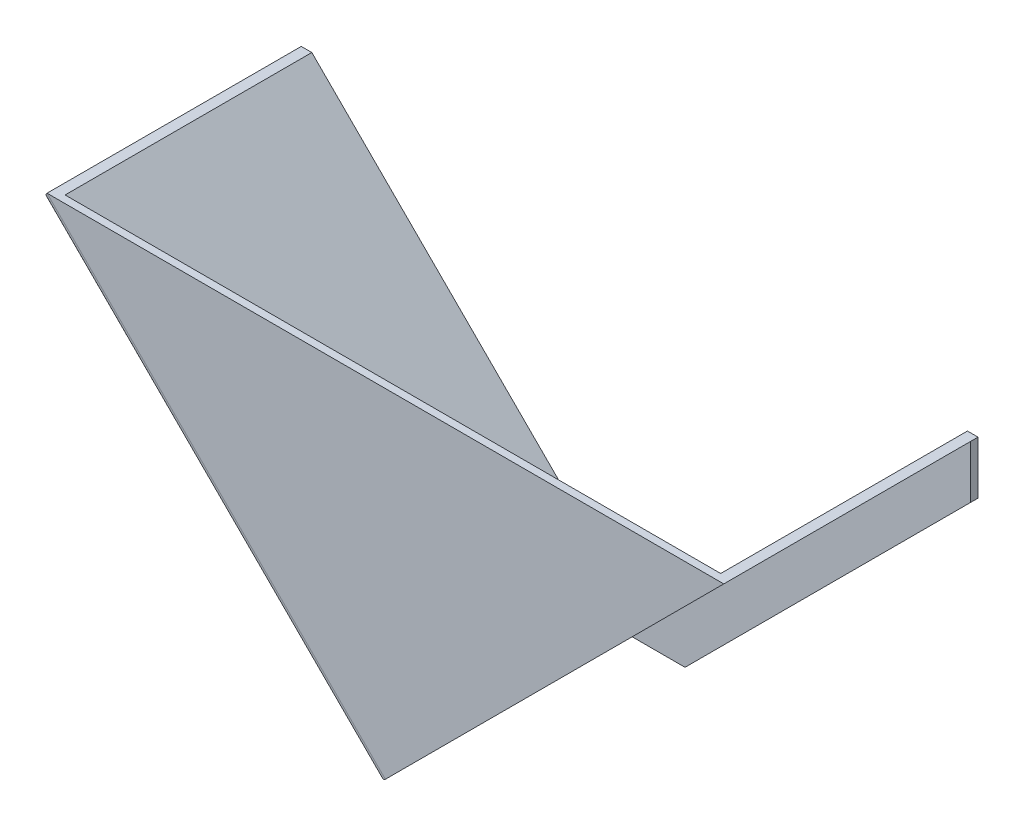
ISO-10303-21;
HEADER;
FILE_DESCRIPTION(('STEP AP214'),'2;1');
FILE_NAME('part.step','',(''),(''),'','','');
FILE_SCHEMA(('AUTOMOTIVE_DESIGN { 1 0 10303 214 1 1 1 1 }'));
ENDSEC;
DATA;
#1=APPLICATION_CONTEXT('core data for automotive mechanical design processes');
#2=APPLICATION_PROTOCOL_DEFINITION('international standard','automotive_design',2000,#1);
#3=PRODUCT_CONTEXT('',#1,'mechanical');
#4=PRODUCT('Part','Part','',(#3));
#5=PRODUCT_RELATED_PRODUCT_CATEGORY('part','',(#4));
#6=PRODUCT_DEFINITION_FORMATION('','',#4);
#7=PRODUCT_DEFINITION_CONTEXT('part definition',#1,'design');
#8=PRODUCT_DEFINITION('design','',#6,#7);
#9=PRODUCT_DEFINITION_SHAPE('','',#8);
#10=(LENGTH_UNIT() NAMED_UNIT(*) SI_UNIT(.MILLI.,.METRE.));
#11=(NAMED_UNIT(*) PLANE_ANGLE_UNIT() SI_UNIT($,.RADIAN.));
#12=(NAMED_UNIT(*) SI_UNIT($,.STERADIAN.) SOLID_ANGLE_UNIT());
#13=UNCERTAINTY_MEASURE_WITH_UNIT(LENGTH_MEASURE(1.E-05),#10,'distance_accuracy_value','');
#14=(GEOMETRIC_REPRESENTATION_CONTEXT(3) GLOBAL_UNCERTAINTY_ASSIGNED_CONTEXT((#13)) GLOBAL_UNIT_ASSIGNED_CONTEXT((#10,
#11,#12)) REPRESENTATION_CONTEXT('',''));
#15=CARTESIAN_POINT('',(0.,0.,0.));
#16=DIRECTION('',(0.,0.,1.));
#17=DIRECTION('',(1.,0.,0.));
#18=AXIS2_PLACEMENT_3D('',#15,#16,#17);
#19=CARTESIAN_POINT('',(0.,0.,0.));
#20=DIRECTION('',(0.,0.,1.));
#21=DIRECTION('',(1.,0.,0.));
#22=AXIS2_PLACEMENT_3D('',#19,#20,#21);
#23=PLANE('',#22);
#24=DIRECTION('',(0.707106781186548,0.707106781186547,0.));
#25=VECTOR('',#24,1.);
#26=CARTESIAN_POINT('',(0.,1.4142135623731,0.));
#27=LINE('',#26,#25);
#28=CARTESIAN_POINT('',(0.,1.4142135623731,0.));
#29=VERTEX_POINT('',#28);
#30=CARTESIAN_POINT('',(43.840620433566,45.2548339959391,0.));
#31=VERTEX_POINT('',#30);
#32=EDGE_CURVE('E206',#29,#31,#27,.T.);
#33=ORIENTED_EDGE('',*,*,#32,.F.);
#34=DIRECTION('',(0.707106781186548,-0.707106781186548,0.));
#35=VECTOR('',#34,1.);
#36=CARTESIAN_POINT('',(-43.840620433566,45.254833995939,0.));
#37=LINE('',#36,#35);
#38=CARTESIAN_POINT('',(-43.840620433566,45.254833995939,0.));
#39=VERTEX_POINT('',#38);
#40=EDGE_CURVE('E144',#39,#29,#37,.T.);
#41=ORIENTED_EDGE('',*,*,#40,.F.);
#42=DIRECTION('',(-1.,0.,0.));
#43=VECTOR('',#42,1.);
#44=CARTESIAN_POINT('',(45.254833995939,45.254833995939,0.));
#45=LINE('',#44,#43);
#46=EDGE_CURVE('E234',#31,#39,#45,.T.);
#47=ORIENTED_EDGE('',*,*,#46,.F.);
#48=EDGE_LOOP('',(#33,#41,#47));
#49=FACE_BOUND('',#48,.T.);
#50=ADVANCED_FACE('F31',(#49),#23,.F.);
#51=CARTESIAN_POINT('',(-45.254833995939,45.254833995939,1.));
#52=DIRECTION('',(0.707106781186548,0.707106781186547,0.));
#53=DIRECTION('',(-0.707106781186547,0.707106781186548,0.));
#54=AXIS2_PLACEMENT_3D('',#51,#52,#53);
#55=PLANE('',#54);
#56=DIRECTION('',(0.,0.,-1.));
#57=VECTOR('',#56,1.);
#58=CARTESIAN_POINT('',(-45.254833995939,45.254833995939,1.));
#59=LINE('',#58,#57);
#60=CARTESIAN_POINT('',(-45.254833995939,45.254833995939,1.));
#61=VERTEX_POINT('',#60);
#62=CARTESIAN_POINT('',(-45.254833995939,45.254833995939,-31.));
#63=VERTEX_POINT('',#62);
#64=EDGE_CURVE('E240',#61,#63,#59,.T.);
#65=ORIENTED_EDGE('',*,*,#64,.T.);
#66=DIRECTION('',(-0.707106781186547,0.707106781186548,0.));
#67=VECTOR('',#66,1.);
#68=CARTESIAN_POINT('',(0.,0.,-31.));
#69=LINE('',#68,#67);
#70=CARTESIAN_POINT('',(0.,0.,-31.0000029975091));
#71=VERTEX_POINT('',#70);
#72=EDGE_CURVE('E261',#63,#71,#69,.F.);
#73=ORIENTED_EDGE('',*,*,#72,.T.);
#74=DIRECTION('',(0.,0.,-1.));
#75=VECTOR('',#74,1.);
#76=CARTESIAN_POINT('',(0.,0.,1.));
#77=LINE('',#76,#75);
#78=CARTESIAN_POINT('',(0.,0.,1.));
#79=VERTEX_POINT('',#78);
#80=EDGE_CURVE('E246',#79,#71,#77,.T.);
#81=ORIENTED_EDGE('',*,*,#80,.F.);
#82=DIRECTION('',(0.499999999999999,-0.499999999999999,0.707106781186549));
#83=VECTOR('',#82,1.);
#84=CARTESIAN_POINT('',(-4.24264068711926,4.24264068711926,-4.99999999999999));
#85=LINE('',#84,#83);
#86=CARTESIAN_POINT('',(-4.24264068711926,4.24264068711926,-4.99999999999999));
#87=VERTEX_POINT('',#86);
#88=EDGE_CURVE('E217',#87,#79,#85,.T.);
#89=ORIENTED_EDGE('',*,*,#88,.F.);
#90=DIRECTION('',(0.707106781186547,-0.707106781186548,0.));
#91=VECTOR('',#90,1.);
#92=CARTESIAN_POINT('',(-41.0121933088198,41.0121933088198,-5.));
#93=LINE('',#92,#91);
#94=CARTESIAN_POINT('',(-41.0121933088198,41.0121933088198,-5.));
#95=VERTEX_POINT('',#94);
#96=EDGE_CURVE('E224',#95,#87,#93,.T.);
#97=ORIENTED_EDGE('',*,*,#96,.F.);
#98=DIRECTION('',(0.499999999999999,-0.499999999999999,-0.707106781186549));
#99=VECTOR('',#98,1.);
#100=CARTESIAN_POINT('',(-45.254833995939,45.254833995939,1.));
#101=LINE('',#100,#99);
#102=EDGE_CURVE('E213',#61,#95,#101,.T.);
#103=ORIENTED_EDGE('',*,*,#102,.F.);
#104=EDGE_LOOP('',(#65,#73,#81,#89,#97,#103));
#105=FACE_BOUND('',#104,.T.);
#106=ADVANCED_FACE('F312',(#105),#55,.F.);
#107=CARTESIAN_POINT('',(0.,0.,1.));
#108=DIRECTION('',(-0.707106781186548,0.707106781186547,0.));
#109=DIRECTION('',(-0.707106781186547,-0.707106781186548,0.));
#110=AXIS2_PLACEMENT_3D('',#107,#108,#109);
#111=PLANE('',#110);
#112=ORIENTED_EDGE('',*,*,#80,.T.);
#113=DIRECTION('',(0.,0.,1.));
#114=VECTOR('',#113,1.);
#115=CARTESIAN_POINT('',(0.,0.,-33.));
#116=LINE('',#115,#114);
#117=CARTESIAN_POINT('',(0.,0.,-32.));
#118=VERTEX_POINT('',#117);
#119=EDGE_CURVE('E11',#118,#71,#116,.T.);
#120=ORIENTED_EDGE('',*,*,#119,.F.);
#121=DIRECTION('',(-0.707106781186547,-0.707106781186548,0.));
#122=VECTOR('',#121,1.);
#123=CARTESIAN_POINT('',(0.,0.,-32.));
#124=LINE('',#123,#122);
#125=CARTESIAN_POINT('',(45.254833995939,45.254833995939,-32.));
#126=VERTEX_POINT('',#125);
#127=EDGE_CURVE('E149',#126,#118,#124,.T.);
#128=ORIENTED_EDGE('',*,*,#127,.F.);
#129=DIRECTION('',(0.,0.,-1.));
#130=VECTOR('',#129,1.);
#131=CARTESIAN_POINT('',(45.254833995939,45.254833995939,1.));
#132=LINE('',#131,#130);
#133=CARTESIAN_POINT('',(45.254833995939,45.254833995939,1.));
#134=VERTEX_POINT('',#133);
#135=EDGE_CURVE('E244',#134,#126,#132,.T.);
#136=ORIENTED_EDGE('',*,*,#135,.F.);
#137=DIRECTION('',(0.707106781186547,0.707106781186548,0.));
#138=VECTOR('',#137,1.);
#139=CARTESIAN_POINT('',(0.,0.,1.));
#140=LINE('',#139,#138);
#141=EDGE_CURVE('E235',#79,#134,#140,.T.);
#142=ORIENTED_EDGE('',*,*,#141,.F.);
#143=EDGE_LOOP('',(#112,#120,#128,#136,#142));
#144=FACE_BOUND('',#143,.T.);
#145=ADVANCED_FACE('F299',(#144),#111,.F.);
#146=CARTESIAN_POINT('',(45.254833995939,45.254833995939,1.));
#147=DIRECTION('',(0.,-1.,0.));
#148=DIRECTION('',(0.,0.,-1.));
#149=AXIS2_PLACEMENT_3D('',#146,#147,#148);
#150=PLANE('',#149);
#151=ORIENTED_EDGE('',*,*,#135,.T.);
#152=DIRECTION('',(0.,0.,1.));
#153=VECTOR('',#152,1.);
#154=CARTESIAN_POINT('',(45.254833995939,45.254833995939,-33.));
#155=LINE('',#154,#153);
#156=CARTESIAN_POINT('',(45.254833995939,45.254833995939,-33.));
#157=VERTEX_POINT('',#156);
#158=EDGE_CURVE('E203',#157,#126,#155,.T.);
#159=ORIENTED_EDGE('',*,*,#158,.F.);
#160=DIRECTION('',(1.,0.,0.));
#161=VECTOR('',#160,1.);
#162=CARTESIAN_POINT('',(45.254833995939,45.254833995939,-33.));
#163=LINE('',#162,#161);
#164=CARTESIAN_POINT('',(43.840620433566,45.2548339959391,-33.));
#165=VERTEX_POINT('',#164);
#166=EDGE_CURVE('E157',#165,#157,#163,.T.);
#167=ORIENTED_EDGE('',*,*,#166,.F.);
#168=DIRECTION('',(0.,0.,1.));
#169=VECTOR('',#168,1.);
#170=CARTESIAN_POINT('',(43.840620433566,45.2548339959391,-32.));
#171=LINE('',#170,#169);
#172=EDGE_CURVE('E154',#165,#31,#171,.T.);
#173=ORIENTED_EDGE('',*,*,#172,.T.);
#174=ORIENTED_EDGE('',*,*,#46,.T.);
#175=DIRECTION('',(0.,0.,1.));
#176=VECTOR('',#175,1.);
#177=CARTESIAN_POINT('',(-43.840620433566,45.254833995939,-32.));
#178=LINE('',#177,#176);
#179=CARTESIAN_POINT('',(-43.840620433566,45.254833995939,-33.));
#180=VERTEX_POINT('',#179);
#181=EDGE_CURVE('E148',#180,#39,#178,.T.);
#182=ORIENTED_EDGE('',*,*,#181,.F.);
#183=DIRECTION('',(1.,0.,0.));
#184=VECTOR('',#183,1.);
#185=CARTESIAN_POINT('',(-43.840620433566,45.254833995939,-33.));
#186=LINE('',#185,#184);
#187=CARTESIAN_POINT('',(-45.254833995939,45.254833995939,-33.));
#188=VERTEX_POINT('',#187);
#189=EDGE_CURVE('E161',#188,#180,#186,.T.);
#190=ORIENTED_EDGE('',*,*,#189,.F.);
#191=DIRECTION('',(0.,0.,1.));
#192=VECTOR('',#191,1.);
#193=CARTESIAN_POINT('',(-45.254833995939,45.254833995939,-33.));
#194=LINE('',#193,#192);
#195=EDGE_CURVE('E46',#188,#63,#194,.T.);
#196=ORIENTED_EDGE('',*,*,#195,.T.);
#197=ORIENTED_EDGE('',*,*,#64,.F.);
#198=DIRECTION('',(-1.,0.,0.));
#199=VECTOR('',#198,1.);
#200=CARTESIAN_POINT('',(45.254833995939,45.254833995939,1.));
#201=LINE('',#200,#199);
#202=EDGE_CURVE('E237',#134,#61,#201,.T.);
#203=ORIENTED_EDGE('',*,*,#202,.F.);
#204=EDGE_LOOP('',(#151,#159,#167,#173,#174,#182,#190,#196,#197,#203));
#205=FACE_BOUND('',#204,.T.);
#206=ADVANCED_FACE('F305',(#205),#150,.F.);
#207=CARTESIAN_POINT('',(0.,0.,1.));
#208=DIRECTION('',(0.,0.,1.));
#209=DIRECTION('',(1.,0.,0.));
#210=AXIS2_PLACEMENT_3D('',#207,#208,#209);
#211=PLANE('',#210);
#212=ORIENTED_EDGE('',*,*,#202,.T.);
#213=DIRECTION('',(-0.707106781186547,0.707106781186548,0.));
#214=VECTOR('',#213,1.);
#215=CARTESIAN_POINT('',(0.,0.,1.));
#216=LINE('',#215,#214);
#217=EDGE_CURVE('E254',#61,#79,#216,.F.);
#218=ORIENTED_EDGE('',*,*,#217,.T.);
#219=ORIENTED_EDGE('',*,*,#141,.T.);
#220=EDGE_LOOP('',(#212,#218,#219));
#221=FACE_BOUND('',#220,.T.);
#222=ADVANCED_FACE('F308',(#221),#211,.T.);
#223=CARTESIAN_POINT('',(-45.9619407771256,44.5477272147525,1.));
#224=DIRECTION('',(0.500000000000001,-0.500000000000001,0.707106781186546));
#225=DIRECTION('',(0.,-0.816496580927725,-0.577350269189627));
#226=AXIS2_PLACEMENT_3D('',#223,#224,#225);
#227=PLANE('',#226);
#228=DIRECTION('',(0.499999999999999,-0.499999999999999,-0.707106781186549));
#229=VECTOR('',#228,1.);
#230=CARTESIAN_POINT('',(-45.9619407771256,44.5477272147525,1.));
#231=LINE('',#230,#229);
#232=CARTESIAN_POINT('',(-45.254833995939,43.840620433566,0.));
#233=VERTEX_POINT('',#232);
#234=CARTESIAN_POINT('',(-41.7193000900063,40.3050865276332,-5.));
#235=VERTEX_POINT('',#234);
#236=EDGE_CURVE('E214',#233,#235,#231,.T.);
#237=ORIENTED_EDGE('',*,*,#236,.F.);
#238=CARTESIAN_POINT('',(-44.5477272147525,44.5477272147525,0.));
#239=DIRECTION('',(0.500000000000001,-0.500000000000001,0.707106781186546));
#240=DIRECTION('',(-0.499999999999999,0.499999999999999,0.707106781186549));
#241=AXIS2_PLACEMENT_3D('',#238,#239,#240);
#242=ELLIPSE('',#241,1.41421356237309,1.);
#243=EDGE_CURVE('E252',#233,#61,#242,.F.);
#244=ORIENTED_EDGE('',*,*,#243,.T.);
#245=ORIENTED_EDGE('',*,*,#102,.T.);
#246=DIRECTION('',(0.707106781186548,0.707106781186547,0.));
#247=VECTOR('',#246,1.);
#248=CARTESIAN_POINT('',(-41.7193000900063,40.3050865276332,-5.));
#249=LINE('',#248,#247);
#250=EDGE_CURVE('E231',#235,#95,#249,.T.);
#251=ORIENTED_EDGE('',*,*,#250,.F.);
#252=EDGE_LOOP('',(#237,#244,#245,#251));
#253=FACE_BOUND('',#252,.T.);
#254=ADVANCED_FACE('F330',(#253),#227,.F.);
#255=CARTESIAN_POINT('',(-41.7193000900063,40.3050865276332,-5.));
#256=DIRECTION('',(0.,0.,1.));
#257=DIRECTION('',(0.,-1.,0.));
#258=AXIS2_PLACEMENT_3D('',#255,#256,#257);
#259=PLANE('',#258);
#260=ORIENTED_EDGE('',*,*,#96,.T.);
#261=DIRECTION('',(0.707106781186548,0.707106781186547,0.));
#262=VECTOR('',#261,1.);
#263=CARTESIAN_POINT('',(-4.94974746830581,3.53553390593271,-4.99999999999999));
#264=LINE('',#263,#262);
#265=CARTESIAN_POINT('',(-4.94974746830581,3.53553390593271,-4.99999999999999));
#266=VERTEX_POINT('',#265);
#267=EDGE_CURVE('E222',#266,#87,#264,.T.);
#268=ORIENTED_EDGE('',*,*,#267,.F.);
#269=DIRECTION('',(0.707106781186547,-0.707106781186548,0.));
#270=VECTOR('',#269,1.);
#271=CARTESIAN_POINT('',(-41.7193000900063,40.3050865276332,-5.));
#272=LINE('',#271,#270);
#273=EDGE_CURVE('E216',#235,#266,#272,.T.);
#274=ORIENTED_EDGE('',*,*,#273,.F.);
#275=ORIENTED_EDGE('',*,*,#250,.T.);
#276=EDGE_LOOP('',(#260,#268,#274,#275));
#277=FACE_BOUND('',#276,.T.);
#278=ADVANCED_FACE('F327',(#277),#259,.F.);
#279=CARTESIAN_POINT('',(-4.94974746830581,3.53553390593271,-4.99999999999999));
#280=DIRECTION('',(-0.500000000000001,0.500000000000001,0.707106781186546));
#281=DIRECTION('',(0.816496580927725,0.,0.577350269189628));
#282=AXIS2_PLACEMENT_3D('',#279,#280,#281);
#283=PLANE('',#282);
#284=ORIENTED_EDGE('',*,*,#88,.T.);
#285=CARTESIAN_POINT('',(-0.707106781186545,0.707106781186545,0.));
#286=DIRECTION('',(-0.500000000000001,0.500000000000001,0.707106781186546));
#287=DIRECTION('',(-0.499999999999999,0.499999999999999,-0.707106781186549));
#288=AXIS2_PLACEMENT_3D('',#285,#286,#287);
#289=ELLIPSE('',#288,1.41421356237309,1.);
#290=CARTESIAN_POINT('',(-1.41421356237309,0.,0.));
#291=VERTEX_POINT('',#290);
#292=EDGE_CURVE('E256',#79,#291,#289,.F.);
#293=ORIENTED_EDGE('',*,*,#292,.T.);
#294=DIRECTION('',(0.499999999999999,-0.499999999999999,0.707106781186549));
#295=VECTOR('',#294,1.);
#296=CARTESIAN_POINT('',(-4.94974746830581,3.53553390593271,-4.99999999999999));
#297=LINE('',#296,#295);
#298=EDGE_CURVE('E219',#266,#291,#297,.T.);
#299=ORIENTED_EDGE('',*,*,#298,.F.);
#300=ORIENTED_EDGE('',*,*,#267,.T.);
#301=EDGE_LOOP('',(#284,#293,#299,#300));
#302=FACE_BOUND('',#301,.T.);
#303=ADVANCED_FACE('F319',(#302),#283,.F.);
#304=CARTESIAN_POINT('',(-0.70710678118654,-0.707106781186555,1.00000000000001));
#305=DIRECTION('',(-0.707106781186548,-0.707106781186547,0.));
#306=DIRECTION('',(0.707106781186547,-0.707106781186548,0.));
#307=AXIS2_PLACEMENT_3D('',#304,#305,#306);
#308=PLANE('',#307);
#309=ORIENTED_EDGE('',*,*,#298,.T.);
#310=DIRECTION('',(-0.707106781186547,0.707106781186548,0.));
#311=VECTOR('',#310,1.);
#312=CARTESIAN_POINT('',(-0.70710678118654,-0.707106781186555,0.));
#313=LINE('',#312,#311);
#314=EDGE_CURVE('E249',#291,#233,#313,.T.);
#315=ORIENTED_EDGE('',*,*,#314,.T.);
#316=ORIENTED_EDGE('',*,*,#236,.T.);
#317=ORIENTED_EDGE('',*,*,#273,.T.);
#318=EDGE_LOOP('',(#309,#315,#316,#317));
#319=FACE_BOUND('',#318,.T.);
#320=ADVANCED_FACE('F321',(#319),#308,.T.);
#321=CARTESIAN_POINT('',(0.,1.4142135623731,-32.));
#322=DIRECTION('',(0.707106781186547,-0.707106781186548,0.));
#323=DIRECTION('',(0.707106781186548,0.707106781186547,0.));
#324=AXIS2_PLACEMENT_3D('',#321,#322,#323);
#325=PLANE('',#324);
#326=ORIENTED_EDGE('',*,*,#32,.T.);
#327=ORIENTED_EDGE('',*,*,#172,.F.);
#328=DIRECTION('',(0.707106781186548,0.707106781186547,0.));
#329=VECTOR('',#328,1.);
#330=CARTESIAN_POINT('',(43.840620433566,45.2548339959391,-33.));
#331=LINE('',#330,#329);
#332=CARTESIAN_POINT('',(0.,1.4142135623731,-33.));
#333=VERTEX_POINT('',#332);
#334=EDGE_CURVE('E152',#333,#165,#331,.T.);
#335=ORIENTED_EDGE('',*,*,#334,.F.);
#336=DIRECTION('',(0.,0.,1.));
#337=VECTOR('',#336,1.);
#338=CARTESIAN_POINT('',(0.,1.4142135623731,-32.));
#339=LINE('',#338,#337);
#340=EDGE_CURVE('E138',#333,#29,#339,.T.);
#341=ORIENTED_EDGE('',*,*,#340,.T.);
#342=EDGE_LOOP('',(#326,#327,#335,#341));
#343=FACE_BOUND('',#342,.T.);
#344=ADVANCED_FACE('F153',(#343),#325,.F.);
#345=CARTESIAN_POINT('',(-43.840620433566,45.254833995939,-32.));
#346=DIRECTION('',(-0.707106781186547,-0.707106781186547,0.));
#347=DIRECTION('',(0.707106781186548,-0.707106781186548,0.));
#348=AXIS2_PLACEMENT_3D('',#345,#346,#347);
#349=PLANE('',#348);
#350=ORIENTED_EDGE('',*,*,#40,.T.);
#351=ORIENTED_EDGE('',*,*,#340,.F.);
#352=DIRECTION('',(0.707106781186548,-0.707106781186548,0.));
#353=VECTOR('',#352,1.);
#354=CARTESIAN_POINT('',(0.,1.4142135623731,-33.));
#355=LINE('',#354,#353);
#356=EDGE_CURVE('E142',#180,#333,#355,.T.);
#357=ORIENTED_EDGE('',*,*,#356,.F.);
#358=ORIENTED_EDGE('',*,*,#181,.T.);
#359=EDGE_LOOP('',(#350,#351,#357,#358));
#360=FACE_BOUND('',#359,.T.);
#361=ADVANCED_FACE('F140',(#360),#349,.F.);
#362=CARTESIAN_POINT('',(4.24264068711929,-2.82842712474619,-32.));
#363=DIRECTION('',(0.,0.,-1.));
#364=DIRECTION('',(-1.,0.,0.));
#365=AXIS2_PLACEMENT_3D('',#362,#363,#364);
#366=PLANE('',#365);
#367=DIRECTION('',(0.,-1.,0.));
#368=VECTOR('',#367,1.);
#369=CARTESIAN_POINT('',(45.254833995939,38.1837661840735,-32.));
#370=LINE('',#369,#368);
#371=CARTESIAN_POINT('',(45.254833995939,38.1837661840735,-32.));
#372=VERTEX_POINT('',#371);
#373=EDGE_CURVE('E180',#126,#372,#370,.T.);
#374=ORIENTED_EDGE('',*,*,#373,.F.);
#375=ORIENTED_EDGE('',*,*,#127,.T.);
#376=DIRECTION('',(-1.,0.,0.));
#377=VECTOR('',#376,1.);
#378=CARTESIAN_POINT('',(-7.07106781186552,0.,-32.));
#379=LINE('',#378,#377);
#380=CARTESIAN_POINT('',(7.07106781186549,0.,-32.));
#381=VERTEX_POINT('',#380);
#382=EDGE_CURVE('E186',#381,#118,#379,.T.);
#383=ORIENTED_EDGE('',*,*,#382,.F.);
#384=DIRECTION('',(-0.707106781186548,-0.707106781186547,0.));
#385=VECTOR('',#384,1.);
#386=CARTESIAN_POINT('',(7.07106781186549,0.,-32.));
#387=LINE('',#386,#385);
#388=EDGE_CURVE('E182',#372,#381,#387,.T.);
#389=ORIENTED_EDGE('',*,*,#388,.F.);
#390=EDGE_LOOP('',(#374,#375,#383,#389));
#391=FACE_BOUND('',#390,.T.);
#392=ADVANCED_FACE('F295',(#391),#366,.F.);
#393=CARTESIAN_POINT('',(-1.41421356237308,0.,-32.));
#394=VERTEX_POINT('',#393);
#395=CARTESIAN_POINT('',(-7.07106781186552,0.,-32.));
#396=VERTEX_POINT('',#395);
#397=EDGE_CURVE('E185',#394,#396,#379,.T.);
#398=ORIENTED_EDGE('',*,*,#397,.F.);
#399=DIRECTION('',(-0.707106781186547,0.707106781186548,0.));
#400=VECTOR('',#399,1.);
#401=CARTESIAN_POINT('',(-45.9619407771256,44.5477272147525,-32.));
#402=LINE('',#401,#400);
#403=CARTESIAN_POINT('',(-45.254833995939,43.840620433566,-32.));
#404=VERTEX_POINT('',#403);
#405=EDGE_CURVE('E258',#394,#404,#402,.T.);
#406=ORIENTED_EDGE('',*,*,#405,.T.);
#407=DIRECTION('',(0.,1.,0.));
#408=VECTOR('',#407,1.);
#409=CARTESIAN_POINT('',(-45.254833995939,45.254833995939,-32.));
#410=LINE('',#409,#408);
#411=CARTESIAN_POINT('',(-45.254833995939,38.1837661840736,-32.));
#412=VERTEX_POINT('',#411);
#413=EDGE_CURVE('E162',#412,#404,#410,.T.);
#414=ORIENTED_EDGE('',*,*,#413,.F.);
#415=DIRECTION('',(-0.707106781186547,0.707106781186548,0.));
#416=VECTOR('',#415,1.);
#417=CARTESIAN_POINT('',(-45.254833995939,38.1837661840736,-32.));
#418=LINE('',#417,#416);
#419=EDGE_CURVE('E165',#396,#412,#418,.T.);
#420=ORIENTED_EDGE('',*,*,#419,.F.);
#421=EDGE_LOOP('',(#398,#406,#414,#420));
#422=FACE_BOUND('',#421,.T.);
#423=ADVANCED_FACE('F276',(#422),#366,.F.);
#424=CARTESIAN_POINT('',(45.254833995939,38.1837661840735,-33.));
#425=DIRECTION('',(-1.,0.,0.));
#426=DIRECTION('',(0.,-1.,0.));
#427=AXIS2_PLACEMENT_3D('',#424,#425,#426);
#428=PLANE('',#427);
#429=ORIENTED_EDGE('',*,*,#373,.T.);
#430=DIRECTION('',(0.,0.,1.));
#431=VECTOR('',#430,1.);
#432=CARTESIAN_POINT('',(45.254833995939,38.1837661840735,-33.));
#433=LINE('',#432,#431);
#434=CARTESIAN_POINT('',(45.254833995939,38.1837661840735,-33.));
#435=VERTEX_POINT('',#434);
#436=EDGE_CURVE('E200',#435,#372,#433,.T.);
#437=ORIENTED_EDGE('',*,*,#436,.F.);
#438=DIRECTION('',(0.,-1.,0.));
#439=VECTOR('',#438,1.);
#440=CARTESIAN_POINT('',(45.254833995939,38.1837661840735,-33.));
#441=LINE('',#440,#439);
#442=EDGE_CURVE('E169',#157,#435,#441,.T.);
#443=ORIENTED_EDGE('',*,*,#442,.F.);
#444=ORIENTED_EDGE('',*,*,#158,.T.);
#445=EDGE_LOOP('',(#429,#437,#443,#444));
#446=FACE_BOUND('',#445,.T.);
#447=ADVANCED_FACE('F304',(#446),#428,.F.);
#448=CARTESIAN_POINT('',(7.07106781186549,0.,-33.));
#449=DIRECTION('',(-0.707106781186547,0.707106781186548,0.));
#450=DIRECTION('',(-0.707106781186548,-0.707106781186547,0.));
#451=AXIS2_PLACEMENT_3D('',#448,#449,#450);
#452=PLANE('',#451);
#453=ORIENTED_EDGE('',*,*,#388,.T.);
#454=DIRECTION('',(0.,0.,1.));
#455=VECTOR('',#454,1.);
#456=CARTESIAN_POINT('',(7.07106781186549,0.,-33.));
#457=LINE('',#456,#455);
#458=CARTESIAN_POINT('',(7.07106781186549,0.,-33.));
#459=VERTEX_POINT('',#458);
#460=EDGE_CURVE('E197',#459,#381,#457,.T.);
#461=ORIENTED_EDGE('',*,*,#460,.F.);
#462=DIRECTION('',(-0.707106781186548,-0.707106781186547,0.));
#463=VECTOR('',#462,1.);
#464=CARTESIAN_POINT('',(7.07106781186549,0.,-33.));
#465=LINE('',#464,#463);
#466=EDGE_CURVE('E171',#435,#459,#465,.T.);
#467=ORIENTED_EDGE('',*,*,#466,.F.);
#468=ORIENTED_EDGE('',*,*,#436,.T.);
#469=EDGE_LOOP('',(#453,#461,#467,#468));
#470=FACE_BOUND('',#469,.T.);
#471=ADVANCED_FACE('F291',(#470),#452,.F.);
#472=CARTESIAN_POINT('',(-7.07106781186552,0.,-33.));
#473=DIRECTION('',(0.,1.,0.));
#474=DIRECTION('',(-1.,0.,0.));
#475=AXIS2_PLACEMENT_3D('',#472,#473,#474);
#476=PLANE('',#475);
#477=ORIENTED_EDGE('',*,*,#382,.T.);
#478=ORIENTED_EDGE('',*,*,#119,.T.);
#479=CARTESIAN_POINT('',(-1.41421356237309,0.,-31.));
#480=DIRECTION('',(0.,1.,0.));
#481=DIRECTION('',(1.,0.,0.));
#482=AXIS2_PLACEMENT_3D('',#479,#480,#481);
#483=ELLIPSE('',#482,1.41421356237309,1.);
#484=EDGE_CURVE('E40',#71,#394,#483,.T.);
#485=ORIENTED_EDGE('',*,*,#484,.T.);
#486=ORIENTED_EDGE('',*,*,#397,.T.);
#487=DIRECTION('',(0.,0.,1.));
#488=VECTOR('',#487,1.);
#489=CARTESIAN_POINT('',(-7.07106781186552,0.,-33.));
#490=LINE('',#489,#488);
#491=CARTESIAN_POINT('',(-7.07106781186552,0.,-33.));
#492=VERTEX_POINT('',#491);
#493=EDGE_CURVE('E194',#492,#396,#490,.T.);
#494=ORIENTED_EDGE('',*,*,#493,.F.);
#495=DIRECTION('',(-1.,0.,0.));
#496=VECTOR('',#495,1.);
#497=CARTESIAN_POINT('',(0.,0.,-33.));
#498=LINE('',#497,#496);
#499=EDGE_CURVE('E173',#459,#492,#498,.T.);
#500=ORIENTED_EDGE('',*,*,#499,.F.);
#501=ORIENTED_EDGE('',*,*,#460,.T.);
#502=EDGE_LOOP('',(#477,#478,#485,#486,#494,#500,#501));
#503=FACE_BOUND('',#502,.T.);
#504=ADVANCED_FACE('F269',(#503),#476,.F.);
#505=CARTESIAN_POINT('',(-45.254833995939,38.1837661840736,-33.));
#506=DIRECTION('',(0.707106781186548,0.707106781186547,0.));
#507=DIRECTION('',(-0.707106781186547,0.707106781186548,0.));
#508=AXIS2_PLACEMENT_3D('',#505,#506,#507);
#509=PLANE('',#508);
#510=ORIENTED_EDGE('',*,*,#419,.T.);
#511=DIRECTION('',(0.,0.,1.));
#512=VECTOR('',#511,1.);
#513=CARTESIAN_POINT('',(-45.254833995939,38.1837661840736,-33.));
#514=LINE('',#513,#512);
#515=CARTESIAN_POINT('',(-45.254833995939,38.1837661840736,-33.));
#516=VERTEX_POINT('',#515);
#517=EDGE_CURVE('E191',#516,#412,#514,.T.);
#518=ORIENTED_EDGE('',*,*,#517,.F.);
#519=DIRECTION('',(-0.707106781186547,0.707106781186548,0.));
#520=VECTOR('',#519,1.);
#521=CARTESIAN_POINT('',(-45.254833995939,38.1837661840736,-33.));
#522=LINE('',#521,#520);
#523=EDGE_CURVE('E175',#492,#516,#522,.T.);
#524=ORIENTED_EDGE('',*,*,#523,.F.);
#525=ORIENTED_EDGE('',*,*,#493,.T.);
#526=EDGE_LOOP('',(#510,#518,#524,#525));
#527=FACE_BOUND('',#526,.T.);
#528=ADVANCED_FACE('F284',(#527),#509,.F.);
#529=CARTESIAN_POINT('',(-45.254833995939,45.254833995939,-33.));
#530=DIRECTION('',(1.,0.,0.));
#531=DIRECTION('',(0.,0.,-1.));
#532=AXIS2_PLACEMENT_3D('',#529,#530,#531);
#533=PLANE('',#532);
#534=ORIENTED_EDGE('',*,*,#413,.T.);
#535=CARTESIAN_POINT('',(-45.254833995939,43.840620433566,-31.));
#536=DIRECTION('',(1.,0.,0.));
#537=DIRECTION('',(0.,-1.,0.));
#538=AXIS2_PLACEMENT_3D('',#535,#536,#537);
#539=ELLIPSE('',#538,1.4142135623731,1.);
#540=EDGE_CURVE('E264',#404,#63,#539,.T.);
#541=ORIENTED_EDGE('',*,*,#540,.T.);
#542=ORIENTED_EDGE('',*,*,#195,.F.);
#543=DIRECTION('',(0.,1.,0.));
#544=VECTOR('',#543,1.);
#545=CARTESIAN_POINT('',(-45.254833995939,45.254833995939,-33.));
#546=LINE('',#545,#544);
#547=EDGE_CURVE('E177',#516,#188,#546,.T.);
#548=ORIENTED_EDGE('',*,*,#547,.F.);
#549=ORIENTED_EDGE('',*,*,#517,.T.);
#550=EDGE_LOOP('',(#534,#541,#542,#548,#549));
#551=FACE_BOUND('',#550,.T.);
#552=ADVANCED_FACE('F279',(#551),#533,.F.);
#553=CARTESIAN_POINT('',(4.24264068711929,-2.82842712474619,-33.));
#554=DIRECTION('',(0.,0.,-1.));
#555=DIRECTION('',(-1.,0.,0.));
#556=AXIS2_PLACEMENT_3D('',#553,#554,#555);
#557=PLANE('',#556);
#558=ORIENTED_EDGE('',*,*,#356,.T.);
#559=ORIENTED_EDGE('',*,*,#334,.T.);
#560=ORIENTED_EDGE('',*,*,#166,.T.);
#561=ORIENTED_EDGE('',*,*,#442,.T.);
#562=ORIENTED_EDGE('',*,*,#466,.T.);
#563=ORIENTED_EDGE('',*,*,#499,.T.);
#564=ORIENTED_EDGE('',*,*,#523,.T.);
#565=ORIENTED_EDGE('',*,*,#547,.T.);
#566=ORIENTED_EDGE('',*,*,#189,.T.);
#567=EDGE_LOOP('',(#558,#559,#560,#561,#562,#563,#564,#565,#566));
#568=FACE_BOUND('',#567,.T.);
#569=ADVANCED_FACE('F160',(#568),#557,.T.);
#570=CARTESIAN_POINT('',(0.,0.,0.));
#571=DIRECTION('',(-0.707106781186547,0.707106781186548,0.));
#572=DIRECTION('',(-0.707106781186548,-0.707106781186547,0.));
#573=AXIS2_PLACEMENT_3D('',#570,#571,#572);
#574=CYLINDRICAL_SURFACE('',#573,1.);
#575=ORIENTED_EDGE('',*,*,#292,.F.);
#576=ORIENTED_EDGE('',*,*,#217,.F.);
#577=ORIENTED_EDGE('',*,*,#243,.F.);
#578=ORIENTED_EDGE('',*,*,#314,.F.);
#579=EDGE_LOOP('',(#575,#576,#577,#578));
#580=FACE_BOUND('',#579,.T.);
#581=ADVANCED_FACE('F316',(#580),#574,.T.);
#582=CARTESIAN_POINT('',(2.8284271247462,-4.24264068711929,-31.));
#583=DIRECTION('',(0.707106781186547,-0.707106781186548,0.));
#584=DIRECTION('',(0.707106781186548,0.707106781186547,0.));
#585=AXIS2_PLACEMENT_3D('',#582,#583,#584);
#586=CYLINDRICAL_SURFACE('',#585,1.);
#587=ORIENTED_EDGE('',*,*,#484,.F.);
#588=ORIENTED_EDGE('',*,*,#72,.F.);
#589=ORIENTED_EDGE('',*,*,#540,.F.);
#590=ORIENTED_EDGE('',*,*,#405,.F.);
#591=EDGE_LOOP('',(#587,#588,#589,#590));
#592=FACE_BOUND('',#591,.T.);
#593=ADVANCED_FACE('F33',(#592),#586,.F.);
#594=CLOSED_SHELL('',(#50,#106,#145,#206,#222,#254,#278,#303,#320,#344,#361,#392,#423,#447,#471,
#504,#528,#552,#569,#581,#593));
#595=MANIFOLD_SOLID_BREP('B2',#594);
#596=ADVANCED_BREP_SHAPE_REPRESENTATION('',(#18,#595),#14);
#597=SHAPE_DEFINITION_REPRESENTATION(#9,#596);
ENDSEC;
END-ISO-10303-21;
